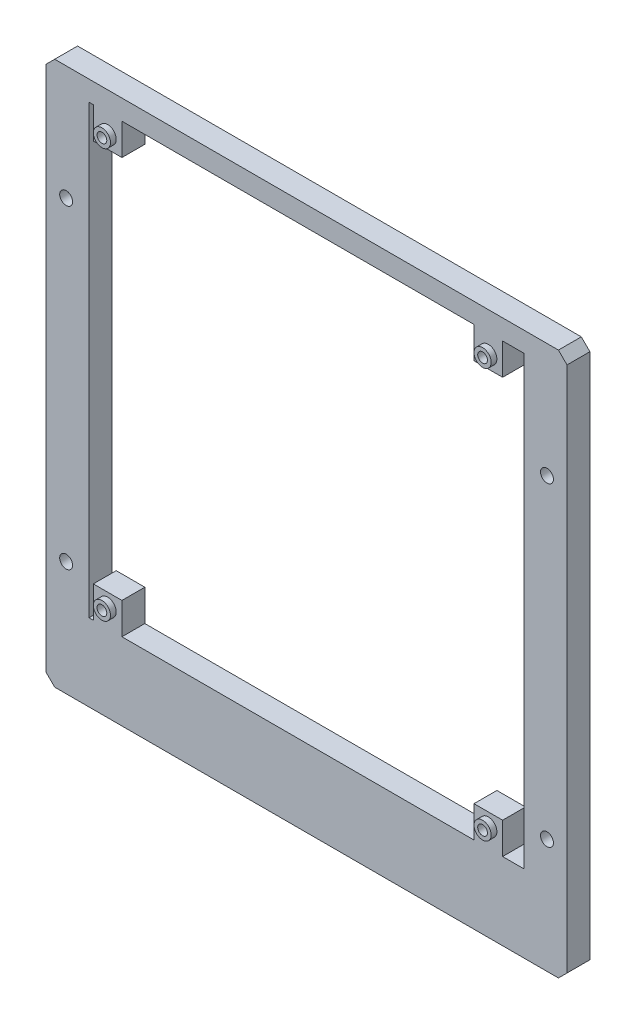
ISO-10303-21;
HEADER;
FILE_DESCRIPTION(('STEP AP214'),'2;1');
FILE_NAME('part.step','',(''),(''),'','','');
FILE_SCHEMA(('AUTOMOTIVE_DESIGN { 1 0 10303 214 1 1 1 1 }'));
ENDSEC;
DATA;
#1=APPLICATION_CONTEXT('core data for automotive mechanical design processes');
#2=APPLICATION_PROTOCOL_DEFINITION('international standard','automotive_design',2000,#1);
#3=PRODUCT_CONTEXT('',#1,'mechanical');
#4=PRODUCT('Part','Part','',(#3));
#5=PRODUCT_RELATED_PRODUCT_CATEGORY('part','',(#4));
#6=PRODUCT_DEFINITION_FORMATION('','',#4);
#7=PRODUCT_DEFINITION_CONTEXT('part definition',#1,'design');
#8=PRODUCT_DEFINITION('design','',#6,#7);
#9=PRODUCT_DEFINITION_SHAPE('','',#8);
#10=(LENGTH_UNIT() NAMED_UNIT(*) SI_UNIT(.MILLI.,.METRE.));
#11=(NAMED_UNIT(*) PLANE_ANGLE_UNIT() SI_UNIT($,.RADIAN.));
#12=(NAMED_UNIT(*) SI_UNIT($,.STERADIAN.) SOLID_ANGLE_UNIT());
#13=UNCERTAINTY_MEASURE_WITH_UNIT(LENGTH_MEASURE(1.E-05),#10,'distance_accuracy_value','');
#14=(GEOMETRIC_REPRESENTATION_CONTEXT(3) GLOBAL_UNCERTAINTY_ASSIGNED_CONTEXT((#13)) GLOBAL_UNIT_ASSIGNED_CONTEXT((#10,
#11,#12)) REPRESENTATION_CONTEXT('',''));
#15=CARTESIAN_POINT('',(0.,0.,0.));
#16=DIRECTION('',(0.,0.,1.));
#17=DIRECTION('',(1.,0.,0.));
#18=AXIS2_PLACEMENT_3D('',#15,#16,#17);
#19=CARTESIAN_POINT('',(0.,0.,8.));
#20=DIRECTION('',(0.,0.,1.));
#21=DIRECTION('',(1.,0.,0.));
#22=AXIS2_PLACEMENT_3D('',#19,#20,#21);
#23=PLANE('',#22);
#24=CARTESIAN_POINT('',(-79.5,81.5,8.));
#25=DIRECTION('',(0.,0.,1.));
#26=DIRECTION('',(1.,0.,0.));
#27=AXIS2_PLACEMENT_3D('',#24,#25,#26);
#28=CIRCLE('',#27,3.);
#29=CARTESIAN_POINT('',(-76.5,81.5,8.));
#30=VERTEX_POINT('',#29);
#31=EDGE_CURVE('E547',#30,#30,#28,.T.);
#32=ORIENTED_EDGE('',*,*,#31,.F.);
#33=EDGE_LOOP('',(#32));
#34=FACE_BOUND('',#33,.T.);
#35=CARTESIAN_POINT('',(-79.5,-61.5,8.));
#36=DIRECTION('',(0.,0.,1.));
#37=DIRECTION('',(1.,0.,0.));
#38=AXIS2_PLACEMENT_3D('',#35,#36,#37);
#39=CIRCLE('',#38,3.);
#40=CARTESIAN_POINT('',(-76.5,-61.5,8.));
#41=VERTEX_POINT('',#40);
#42=EDGE_CURVE('E534',#41,#41,#39,.T.);
#43=ORIENTED_EDGE('',*,*,#42,.F.);
#44=EDGE_LOOP('',(#43));
#45=FACE_BOUND('',#44,.T.);
#46=DIRECTION('',(-1.,0.,0.));
#47=VECTOR('',#46,1.);
#48=CARTESIAN_POINT('',(66.,88.,8.));
#49=LINE('',#48,#47);
#50=CARTESIAN_POINT('',(48.5,88.,8.));
#51=VERTEX_POINT('',#50);
#52=CARTESIAN_POINT('',(-74.5,88.,8.));
#53=VERTEX_POINT('',#52);
#54=EDGE_CURVE('E237',#51,#53,#49,.T.);
#55=ORIENTED_EDGE('',*,*,#54,.F.);
#56=DIRECTION('',(0.,-1.,0.));
#57=VECTOR('',#56,1.);
#58=CARTESIAN_POINT('',(48.5,92.,8.));
#59=LINE('',#58,#57);
#60=CARTESIAN_POINT('',(48.5,77.,8.));
#61=VERTEX_POINT('',#60);
#62=EDGE_CURVE('E230',#51,#61,#59,.T.);
#63=ORIENTED_EDGE('',*,*,#62,.T.);
#64=DIRECTION('',(1.,0.,0.));
#65=VECTOR('',#64,1.);
#66=CARTESIAN_POINT('',(48.5,77.,8.));
#67=LINE('',#66,#65);
#68=CARTESIAN_POINT('',(58.5,77.,8.));
#69=VERTEX_POINT('',#68);
#70=EDGE_CURVE('E234',#61,#69,#67,.T.);
#71=ORIENTED_EDGE('',*,*,#70,.T.);
#72=DIRECTION('',(0.,1.,0.));
#73=VECTOR('',#72,1.);
#74=CARTESIAN_POINT('',(58.5,77.,8.));
#75=LINE('',#74,#73);
#76=CARTESIAN_POINT('',(58.5,88.,8.));
#77=VERTEX_POINT('',#76);
#78=EDGE_CURVE('E248',#69,#77,#75,.T.);
#79=ORIENTED_EDGE('',*,*,#78,.T.);
#80=CARTESIAN_POINT('',(66.,88.,8.));
#81=VERTEX_POINT('',#80);
#82=EDGE_CURVE('E369',#81,#77,#49,.T.);
#83=ORIENTED_EDGE('',*,*,#82,.F.);
#84=DIRECTION('',(0.,1.,0.));
#85=VECTOR('',#84,1.);
#86=CARTESIAN_POINT('',(66.,-68.,8.));
#87=LINE('',#86,#85);
#88=CARTESIAN_POINT('',(66.,-68.,8.));
#89=VERTEX_POINT('',#88);
#90=EDGE_CURVE('E364',#89,#81,#87,.T.);
#91=ORIENTED_EDGE('',*,*,#90,.F.);
#92=DIRECTION('',(1.,0.,0.));
#93=VECTOR('',#92,1.);
#94=CARTESIAN_POINT('',(-86.,-68.,8.));
#95=LINE('',#94,#93);
#96=CARTESIAN_POINT('',(58.5,-68.,8.));
#97=VERTEX_POINT('',#96);
#98=EDGE_CURVE('E359',#97,#89,#95,.T.);
#99=ORIENTED_EDGE('',*,*,#98,.F.);
#100=DIRECTION('',(0.,1.,0.));
#101=VECTOR('',#100,1.);
#102=CARTESIAN_POINT('',(58.5,-92.,8.));
#103=LINE('',#102,#101);
#104=CARTESIAN_POINT('',(58.5,-57.,8.));
#105=VERTEX_POINT('',#104);
#106=EDGE_CURVE('E289',#97,#105,#103,.T.);
#107=ORIENTED_EDGE('',*,*,#106,.T.);
#108=DIRECTION('',(-1.,0.,0.));
#109=VECTOR('',#108,1.);
#110=CARTESIAN_POINT('',(58.5,-57.,8.));
#111=LINE('',#110,#109);
#112=CARTESIAN_POINT('',(48.5,-57.,8.));
#113=VERTEX_POINT('',#112);
#114=EDGE_CURVE('E292',#105,#113,#111,.T.);
#115=ORIENTED_EDGE('',*,*,#114,.T.);
#116=DIRECTION('',(0.,-1.,0.));
#117=VECTOR('',#116,1.);
#118=CARTESIAN_POINT('',(48.5,-57.,8.));
#119=LINE('',#118,#117);
#120=CARTESIAN_POINT('',(48.5,-68.,8.));
#121=VERTEX_POINT('',#120);
#122=EDGE_CURVE('E286',#113,#121,#119,.T.);
#123=ORIENTED_EDGE('',*,*,#122,.T.);
#124=CARTESIAN_POINT('',(-74.5,-68.,8.));
#125=VERTEX_POINT('',#124);
#126=EDGE_CURVE('E365',#125,#121,#95,.T.);
#127=ORIENTED_EDGE('',*,*,#126,.F.);
#128=DIRECTION('',(0.,1.,0.));
#129=VECTOR('',#128,1.);
#130=CARTESIAN_POINT('',(-74.5,-92.,8.));
#131=LINE('',#130,#129);
#132=CARTESIAN_POINT('',(-74.5,-57.,8.));
#133=VERTEX_POINT('',#132);
#134=EDGE_CURVE('E317',#125,#133,#131,.T.);
#135=ORIENTED_EDGE('',*,*,#134,.T.);
#136=DIRECTION('',(-1.,0.,0.));
#137=VECTOR('',#136,1.);
#138=CARTESIAN_POINT('',(-74.5,-57.,8.));
#139=LINE('',#138,#137);
#140=CARTESIAN_POINT('',(-84.5,-57.,8.));
#141=VERTEX_POINT('',#140);
#142=EDGE_CURVE('E320',#133,#141,#139,.T.);
#143=ORIENTED_EDGE('',*,*,#142,.T.);
#144=DIRECTION('',(0.,-1.,0.));
#145=VECTOR('',#144,1.);
#146=CARTESIAN_POINT('',(-84.5,-57.,8.));
#147=LINE('',#146,#145);
#148=CARTESIAN_POINT('',(-84.5,-68.,8.));
#149=VERTEX_POINT('',#148);
#150=EDGE_CURVE('E314',#141,#149,#147,.T.);
#151=ORIENTED_EDGE('',*,*,#150,.T.);
#152=CARTESIAN_POINT('',(-86.,-68.,8.));
#153=VERTEX_POINT('',#152);
#154=EDGE_CURVE('E361',#153,#149,#95,.T.);
#155=ORIENTED_EDGE('',*,*,#154,.F.);
#156=DIRECTION('',(0.,-1.,0.));
#157=VECTOR('',#156,1.);
#158=CARTESIAN_POINT('',(-86.,88.,8.));
#159=LINE('',#158,#157);
#160=CARTESIAN_POINT('',(-86.,88.,8.));
#161=VERTEX_POINT('',#160);
#162=EDGE_CURVE('E357',#161,#153,#159,.T.);
#163=ORIENTED_EDGE('',*,*,#162,.F.);
#164=CARTESIAN_POINT('',(-84.5,88.,8.));
#165=VERTEX_POINT('',#164);
#166=EDGE_CURVE('E368',#165,#161,#49,.T.);
#167=ORIENTED_EDGE('',*,*,#166,.F.);
#168=DIRECTION('',(0.,-1.,0.));
#169=VECTOR('',#168,1.);
#170=CARTESIAN_POINT('',(-84.5,92.,8.));
#171=LINE('',#170,#169);
#172=CARTESIAN_POINT('',(-84.5,77.,8.));
#173=VERTEX_POINT('',#172);
#174=EDGE_CURVE('E265',#165,#173,#171,.T.);
#175=ORIENTED_EDGE('',*,*,#174,.T.);
#176=DIRECTION('',(1.,0.,0.));
#177=VECTOR('',#176,1.);
#178=CARTESIAN_POINT('',(-84.5,77.,8.));
#179=LINE('',#178,#177);
#180=CARTESIAN_POINT('',(-74.5,77.,8.));
#181=VERTEX_POINT('',#180);
#182=EDGE_CURVE('E267',#173,#181,#179,.T.);
#183=ORIENTED_EDGE('',*,*,#182,.T.);
#184=DIRECTION('',(0.,1.,0.));
#185=VECTOR('',#184,1.);
#186=CARTESIAN_POINT('',(-74.5,77.,8.));
#187=LINE('',#186,#185);
#188=EDGE_CURVE('E270',#181,#53,#187,.T.);
#189=ORIENTED_EDGE('',*,*,#188,.T.);
#190=EDGE_LOOP('',(#55,#63,#71,#79,#83,#91,#99,#107,#115,#123,#127,#135,#143,#151,#155,#163,
#167,#175,#183,#189));
#191=FACE_BOUND('',#190,.T.);
#192=CARTESIAN_POINT('',(74.,-55.,8.));
#193=DIRECTION('',(0.,0.,1.));
#194=DIRECTION('',(1.,0.,0.));
#195=AXIS2_PLACEMENT_3D('',#192,#193,#194);
#196=CIRCLE('',#195,2.25);
#197=CARTESIAN_POINT('',(76.25,-55.,8.));
#198=VERTEX_POINT('',#197);
#199=EDGE_CURVE('E339',#198,#198,#196,.T.);
#200=ORIENTED_EDGE('',*,*,#199,.F.);
#201=EDGE_LOOP('',(#200));
#202=FACE_BOUND('',#201,.T.);
#203=CARTESIAN_POINT('',(-94.,-55.,8.));
#204=DIRECTION('',(0.,0.,1.));
#205=DIRECTION('',(1.,0.,0.));
#206=AXIS2_PLACEMENT_3D('',#203,#204,#205);
#207=CIRCLE('',#206,2.25);
#208=CARTESIAN_POINT('',(-91.75,-55.,8.));
#209=VERTEX_POINT('',#208);
#210=EDGE_CURVE('E351',#209,#209,#207,.T.);
#211=ORIENTED_EDGE('',*,*,#210,.F.);
#212=EDGE_LOOP('',(#211));
#213=FACE_BOUND('',#212,.T.);
#214=DIRECTION('',(0.707106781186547,-0.707106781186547,0.));
#215=VECTOR('',#214,1.);
#216=CARTESIAN_POINT('',(-101.,-92.,8.));
#217=LINE('',#216,#215);
#218=CARTESIAN_POINT('',(-101.,-92.,8.));
#219=VERTEX_POINT('',#218);
#220=CARTESIAN_POINT('',(-98.,-95.,8.));
#221=VERTEX_POINT('',#220);
#222=EDGE_CURVE('E397',#219,#221,#217,.T.);
#223=ORIENTED_EDGE('',*,*,#222,.T.);
#224=DIRECTION('',(1.,0.,0.));
#225=VECTOR('',#224,1.);
#226=CARTESIAN_POINT('',(-98.,-95.,8.));
#227=LINE('',#226,#225);
#228=CARTESIAN_POINT('',(78.,-95.,8.));
#229=VERTEX_POINT('',#228);
#230=EDGE_CURVE('E400',#221,#229,#227,.T.);
#231=ORIENTED_EDGE('',*,*,#230,.T.);
#232=DIRECTION('',(0.707106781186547,0.707106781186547,0.));
#233=VECTOR('',#232,1.);
#234=CARTESIAN_POINT('',(78.,-95.,8.));
#235=LINE('',#234,#233);
#236=CARTESIAN_POINT('',(81.,-92.,8.));
#237=VERTEX_POINT('',#236);
#238=EDGE_CURVE('E403',#229,#237,#235,.T.);
#239=ORIENTED_EDGE('',*,*,#238,.T.);
#240=DIRECTION('',(0.,1.,0.));
#241=VECTOR('',#240,1.);
#242=CARTESIAN_POINT('',(81.,-92.,8.));
#243=LINE('',#242,#241);
#244=CARTESIAN_POINT('',(81.,92.,8.));
#245=VERTEX_POINT('',#244);
#246=EDGE_CURVE('E405',#237,#245,#243,.T.);
#247=ORIENTED_EDGE('',*,*,#246,.T.);
#248=DIRECTION('',(-0.707106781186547,0.707106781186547,0.));
#249=VECTOR('',#248,1.);
#250=CARTESIAN_POINT('',(81.,92.,8.));
#251=LINE('',#250,#249);
#252=CARTESIAN_POINT('',(78.,95.,8.));
#253=VERTEX_POINT('',#252);
#254=EDGE_CURVE('E407',#245,#253,#251,.T.);
#255=ORIENTED_EDGE('',*,*,#254,.T.);
#256=DIRECTION('',(-1.,0.,0.));
#257=VECTOR('',#256,1.);
#258=CARTESIAN_POINT('',(78.,95.,8.));
#259=LINE('',#258,#257);
#260=CARTESIAN_POINT('',(-98.,95.,8.));
#261=VERTEX_POINT('',#260);
#262=EDGE_CURVE('E409',#253,#261,#259,.T.);
#263=ORIENTED_EDGE('',*,*,#262,.T.);
#264=DIRECTION('',(-0.707106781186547,-0.707106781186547,0.));
#265=VECTOR('',#264,1.);
#266=CARTESIAN_POINT('',(-98.,95.,8.));
#267=LINE('',#266,#265);
#268=CARTESIAN_POINT('',(-101.,92.,8.));
#269=VERTEX_POINT('',#268);
#270=EDGE_CURVE('E411',#261,#269,#267,.T.);
#271=ORIENTED_EDGE('',*,*,#270,.T.);
#272=DIRECTION('',(0.,-1.,0.));
#273=VECTOR('',#272,1.);
#274=CARTESIAN_POINT('',(-101.,92.,8.));
#275=LINE('',#274,#273);
#276=EDGE_CURVE('E413',#269,#219,#275,.T.);
#277=ORIENTED_EDGE('',*,*,#276,.T.);
#278=EDGE_LOOP('',(#223,#231,#239,#247,#255,#263,#271,#277));
#279=FACE_BOUND('',#278,.T.);
#280=CARTESIAN_POINT('',(-94.,55.,8.));
#281=DIRECTION('',(0.,0.,1.));
#282=DIRECTION('',(1.,0.,0.));
#283=AXIS2_PLACEMENT_3D('',#280,#281,#282);
#284=CIRCLE('',#283,2.25);
#285=CARTESIAN_POINT('',(-91.75,55.,8.));
#286=VERTEX_POINT('',#285);
#287=EDGE_CURVE('E345',#286,#286,#284,.T.);
#288=ORIENTED_EDGE('',*,*,#287,.F.);
#289=EDGE_LOOP('',(#288));
#290=FACE_BOUND('',#289,.T.);
#291=CARTESIAN_POINT('',(74.,55.,8.));
#292=DIRECTION('',(0.,0.,1.));
#293=DIRECTION('',(1.,0.,0.));
#294=AXIS2_PLACEMENT_3D('',#291,#292,#293);
#295=CIRCLE('',#294,2.25);
#296=CARTESIAN_POINT('',(76.25,55.,8.));
#297=VERTEX_POINT('',#296);
#298=EDGE_CURVE('E333',#297,#297,#295,.T.);
#299=ORIENTED_EDGE('',*,*,#298,.F.);
#300=EDGE_LOOP('',(#299));
#301=FACE_BOUND('',#300,.T.);
#302=CARTESIAN_POINT('',(53.5,81.5,8.));
#303=DIRECTION('',(0.,0.,1.));
#304=DIRECTION('',(1.,0.,0.));
#305=AXIS2_PLACEMENT_3D('',#302,#303,#304);
#306=CIRCLE('',#305,3.);
#307=CARTESIAN_POINT('',(56.5,81.5,8.));
#308=VERTEX_POINT('',#307);
#309=EDGE_CURVE('E563',#308,#308,#306,.T.);
#310=ORIENTED_EDGE('',*,*,#309,.F.);
#311=EDGE_LOOP('',(#310));
#312=FACE_BOUND('',#311,.T.);
#313=CARTESIAN_POINT('',(53.5,-61.5,8.));
#314=DIRECTION('',(0.,0.,1.));
#315=DIRECTION('',(1.,0.,0.));
#316=AXIS2_PLACEMENT_3D('',#313,#314,#315);
#317=CIRCLE('',#316,3.);
#318=CARTESIAN_POINT('',(56.5,-61.5,8.));
#319=VERTEX_POINT('',#318);
#320=EDGE_CURVE('E556',#319,#319,#317,.T.);
#321=ORIENTED_EDGE('',*,*,#320,.F.);
#322=EDGE_LOOP('',(#321));
#323=FACE_BOUND('',#322,.T.);
#324=ADVANCED_FACE('F43',(#34,#45,#191,#202,#213,#279,#290,#301,#312,#323),#23,.T.);
#325=CARTESIAN_POINT('',(66.,88.,8.));
#326=DIRECTION('',(0.,-1.,0.));
#327=DIRECTION('',(0.,0.,-1.));
#328=AXIS2_PLACEMENT_3D('',#325,#326,#327);
#329=PLANE('',#328);
#330=DIRECTION('',(-1.,0.,0.));
#331=VECTOR('',#330,1.);
#332=CARTESIAN_POINT('',(66.,88.,0.));
#333=LINE('',#332,#331);
#334=CARTESIAN_POINT('',(48.5,88.,0.));
#335=VERTEX_POINT('',#334);
#336=CARTESIAN_POINT('',(-74.5,88.,0.));
#337=VERTEX_POINT('',#336);
#338=EDGE_CURVE('E66',#335,#337,#333,.T.);
#339=ORIENTED_EDGE('',*,*,#338,.F.);
#340=DIRECTION('',(0.,0.,1.));
#341=VECTOR('',#340,1.);
#342=CARTESIAN_POINT('',(48.5,88.,8.));
#343=LINE('',#342,#341);
#344=EDGE_CURVE('E255',#335,#51,#343,.T.);
#345=ORIENTED_EDGE('',*,*,#344,.T.);
#346=ORIENTED_EDGE('',*,*,#54,.T.);
#347=DIRECTION('',(0.,0.,-1.));
#348=VECTOR('',#347,1.);
#349=CARTESIAN_POINT('',(-74.5,88.,8.));
#350=LINE('',#349,#348);
#351=EDGE_CURVE('E51',#53,#337,#350,.T.);
#352=ORIENTED_EDGE('',*,*,#351,.T.);
#353=EDGE_LOOP('',(#339,#345,#346,#352));
#354=FACE_BOUND('',#353,.T.);
#355=ADVANCED_FACE('F462',(#354),#329,.T.);
#356=ORIENTED_EDGE('',*,*,#82,.T.);
#357=DIRECTION('',(0.,0.,-1.));
#358=VECTOR('',#357,1.);
#359=CARTESIAN_POINT('',(58.5,88.,8.));
#360=LINE('',#359,#358);
#361=CARTESIAN_POINT('',(58.5,88.,0.));
#362=VERTEX_POINT('',#361);
#363=EDGE_CURVE('E253',#77,#362,#360,.T.);
#364=ORIENTED_EDGE('',*,*,#363,.T.);
#365=CARTESIAN_POINT('',(66.,88.,0.));
#366=VERTEX_POINT('',#365);
#367=EDGE_CURVE('E360',#366,#362,#333,.T.);
#368=ORIENTED_EDGE('',*,*,#367,.F.);
#369=DIRECTION('',(0.,0.,-1.));
#370=VECTOR('',#369,1.);
#371=CARTESIAN_POINT('',(66.,88.,8.));
#372=LINE('',#371,#370);
#373=EDGE_CURVE('E388',#81,#366,#372,.T.);
#374=ORIENTED_EDGE('',*,*,#373,.F.);
#375=EDGE_LOOP('',(#356,#364,#368,#374));
#376=FACE_BOUND('',#375,.T.);
#377=ADVANCED_FACE('F524',(#376),#329,.T.);
#378=CARTESIAN_POINT('',(-84.5,88.,0.));
#379=VERTEX_POINT('',#378);
#380=CARTESIAN_POINT('',(-86.,88.,0.));
#381=VERTEX_POINT('',#380);
#382=EDGE_CURVE('E383',#379,#381,#333,.T.);
#383=ORIENTED_EDGE('',*,*,#382,.F.);
#384=DIRECTION('',(0.,0.,1.));
#385=VECTOR('',#384,1.);
#386=CARTESIAN_POINT('',(-84.5,88.,8.));
#387=LINE('',#386,#385);
#388=EDGE_CURVE('E11',#379,#165,#387,.T.);
#389=ORIENTED_EDGE('',*,*,#388,.T.);
#390=ORIENTED_EDGE('',*,*,#166,.T.);
#391=DIRECTION('',(0.,0.,-1.));
#392=VECTOR('',#391,1.);
#393=CARTESIAN_POINT('',(-86.,88.,8.));
#394=LINE('',#393,#392);
#395=EDGE_CURVE('E372',#161,#381,#394,.T.);
#396=ORIENTED_EDGE('',*,*,#395,.T.);
#397=EDGE_LOOP('',(#383,#389,#390,#396));
#398=FACE_BOUND('',#397,.T.);
#399=ADVANCED_FACE('F480',(#398),#329,.T.);
#400=CARTESIAN_POINT('',(-86.,-68.,8.));
#401=DIRECTION('',(0.,1.,0.));
#402=DIRECTION('',(0.,0.,1.));
#403=AXIS2_PLACEMENT_3D('',#400,#401,#402);
#404=PLANE('',#403);
#405=ORIENTED_EDGE('',*,*,#126,.T.);
#406=DIRECTION('',(0.,0.,-1.));
#407=VECTOR('',#406,1.);
#408=CARTESIAN_POINT('',(48.5,-68.,8.));
#409=LINE('',#408,#407);
#410=CARTESIAN_POINT('',(48.5,-68.,0.));
#411=VERTEX_POINT('',#410);
#412=EDGE_CURVE('E307',#121,#411,#409,.T.);
#413=ORIENTED_EDGE('',*,*,#412,.T.);
#414=DIRECTION('',(1.,0.,0.));
#415=VECTOR('',#414,1.);
#416=CARTESIAN_POINT('',(-86.,-68.,0.));
#417=LINE('',#416,#415);
#418=CARTESIAN_POINT('',(-74.5,-68.,0.));
#419=VERTEX_POINT('',#418);
#420=EDGE_CURVE('E380',#419,#411,#417,.T.);
#421=ORIENTED_EDGE('',*,*,#420,.F.);
#422=DIRECTION('',(0.,0.,1.));
#423=VECTOR('',#422,1.);
#424=CARTESIAN_POINT('',(-74.5,-68.,8.));
#425=LINE('',#424,#423);
#426=EDGE_CURVE('E454',#419,#125,#425,.T.);
#427=ORIENTED_EDGE('',*,*,#426,.T.);
#428=EDGE_LOOP('',(#405,#413,#421,#427));
#429=FACE_BOUND('',#428,.T.);
#430=ADVANCED_FACE('F508',(#429),#404,.T.);
#431=CARTESIAN_POINT('',(58.5,-68.,0.));
#432=VERTEX_POINT('',#431);
#433=CARTESIAN_POINT('',(66.,-68.,0.));
#434=VERTEX_POINT('',#433);
#435=EDGE_CURVE('E375',#432,#434,#417,.T.);
#436=ORIENTED_EDGE('',*,*,#435,.F.);
#437=DIRECTION('',(0.,0.,1.));
#438=VECTOR('',#437,1.);
#439=CARTESIAN_POINT('',(58.5,-68.,8.));
#440=LINE('',#439,#438);
#441=EDGE_CURVE('E304',#432,#97,#440,.T.);
#442=ORIENTED_EDGE('',*,*,#441,.T.);
#443=ORIENTED_EDGE('',*,*,#98,.T.);
#444=DIRECTION('',(0.,0.,-1.));
#445=VECTOR('',#444,1.);
#446=CARTESIAN_POINT('',(66.,-68.,8.));
#447=LINE('',#446,#445);
#448=EDGE_CURVE('E390',#89,#434,#447,.T.);
#449=ORIENTED_EDGE('',*,*,#448,.T.);
#450=EDGE_LOOP('',(#436,#442,#443,#449));
#451=FACE_BOUND('',#450,.T.);
#452=ADVANCED_FACE('F516',(#451),#404,.T.);
#453=ORIENTED_EDGE('',*,*,#154,.T.);
#454=DIRECTION('',(0.,0.,-1.));
#455=VECTOR('',#454,1.);
#456=CARTESIAN_POINT('',(-84.5,-68.,8.));
#457=LINE('',#456,#455);
#458=CARTESIAN_POINT('',(-84.5,-68.,0.));
#459=VERTEX_POINT('',#458);
#460=EDGE_CURVE('E457',#149,#459,#457,.T.);
#461=ORIENTED_EDGE('',*,*,#460,.T.);
#462=CARTESIAN_POINT('',(-86.,-68.,0.));
#463=VERTEX_POINT('',#462);
#464=EDGE_CURVE('E376',#463,#459,#417,.T.);
#465=ORIENTED_EDGE('',*,*,#464,.F.);
#466=DIRECTION('',(0.,0.,-1.));
#467=VECTOR('',#466,1.);
#468=CARTESIAN_POINT('',(-86.,-68.,8.));
#469=LINE('',#468,#467);
#470=EDGE_CURVE('E393',#153,#463,#469,.T.);
#471=ORIENTED_EDGE('',*,*,#470,.F.);
#472=EDGE_LOOP('',(#453,#461,#465,#471));
#473=FACE_BOUND('',#472,.T.);
#474=ADVANCED_FACE('F489',(#473),#404,.T.);
#475=CARTESIAN_POINT('',(0.,0.,0.));
#476=DIRECTION('',(0.,0.,1.));
#477=DIRECTION('',(1.,0.,0.));
#478=AXIS2_PLACEMENT_3D('',#475,#476,#477);
#479=PLANE('',#478);
#480=ORIENTED_EDGE('',*,*,#367,.T.);
#481=DIRECTION('',(0.,1.,0.));
#482=VECTOR('',#481,1.);
#483=CARTESIAN_POINT('',(58.5,77.,0.));
#484=LINE('',#483,#482);
#485=CARTESIAN_POINT('',(58.5,77.,0.));
#486=VERTEX_POINT('',#485);
#487=EDGE_CURVE('E58',#486,#362,#484,.T.);
#488=ORIENTED_EDGE('',*,*,#487,.F.);
#489=DIRECTION('',(1.,0.,0.));
#490=VECTOR('',#489,1.);
#491=CARTESIAN_POINT('',(48.5,77.,0.));
#492=LINE('',#491,#490);
#493=CARTESIAN_POINT('',(48.5,77.,0.));
#494=VERTEX_POINT('',#493);
#495=EDGE_CURVE('E525',#494,#486,#492,.T.);
#496=ORIENTED_EDGE('',*,*,#495,.F.);
#497=DIRECTION('',(0.,-1.,0.));
#498=VECTOR('',#497,1.);
#499=CARTESIAN_POINT('',(48.5,92.,0.));
#500=LINE('',#499,#498);
#501=EDGE_CURVE('E251',#335,#494,#500,.T.);
#502=ORIENTED_EDGE('',*,*,#501,.F.);
#503=ORIENTED_EDGE('',*,*,#338,.T.);
#504=DIRECTION('',(0.,1.,0.));
#505=VECTOR('',#504,1.);
#506=CARTESIAN_POINT('',(-74.5,77.,0.));
#507=LINE('',#506,#505);
#508=CARTESIAN_POINT('',(-74.5,77.,0.));
#509=VERTEX_POINT('',#508);
#510=EDGE_CURVE('E268',#509,#337,#507,.T.);
#511=ORIENTED_EDGE('',*,*,#510,.F.);
#512=DIRECTION('',(1.,0.,0.));
#513=VECTOR('',#512,1.);
#514=CARTESIAN_POINT('',(-84.5,77.,0.));
#515=LINE('',#514,#513);
#516=CARTESIAN_POINT('',(-84.5,77.,0.));
#517=VERTEX_POINT('',#516);
#518=EDGE_CURVE('E274',#517,#509,#515,.T.);
#519=ORIENTED_EDGE('',*,*,#518,.F.);
#520=DIRECTION('',(0.,-1.,0.));
#521=VECTOR('',#520,1.);
#522=CARTESIAN_POINT('',(-84.5,92.,0.));
#523=LINE('',#522,#521);
#524=EDGE_CURVE('E264',#379,#517,#523,.T.);
#525=ORIENTED_EDGE('',*,*,#524,.F.);
#526=ORIENTED_EDGE('',*,*,#382,.T.);
#527=DIRECTION('',(0.,-1.,0.));
#528=VECTOR('',#527,1.);
#529=CARTESIAN_POINT('',(-86.,88.,0.));
#530=LINE('',#529,#528);
#531=EDGE_CURVE('E354',#381,#463,#530,.T.);
#532=ORIENTED_EDGE('',*,*,#531,.T.);
#533=ORIENTED_EDGE('',*,*,#464,.T.);
#534=DIRECTION('',(0.,-1.,0.));
#535=VECTOR('',#534,1.);
#536=CARTESIAN_POINT('',(-84.5,-57.,0.));
#537=LINE('',#536,#535);
#538=CARTESIAN_POINT('',(-84.5,-57.,0.));
#539=VERTEX_POINT('',#538);
#540=EDGE_CURVE('E313',#539,#459,#537,.T.);
#541=ORIENTED_EDGE('',*,*,#540,.F.);
#542=DIRECTION('',(-1.,0.,0.));
#543=VECTOR('',#542,1.);
#544=CARTESIAN_POINT('',(-74.5,-57.,0.));
#545=LINE('',#544,#543);
#546=CARTESIAN_POINT('',(-74.5,-57.,0.));
#547=VERTEX_POINT('',#546);
#548=EDGE_CURVE('E318',#547,#539,#545,.T.);
#549=ORIENTED_EDGE('',*,*,#548,.F.);
#550=DIRECTION('',(0.,1.,0.));
#551=VECTOR('',#550,1.);
#552=CARTESIAN_POINT('',(-74.5,-92.,0.));
#553=LINE('',#552,#551);
#554=EDGE_CURVE('E324',#419,#547,#553,.T.);
#555=ORIENTED_EDGE('',*,*,#554,.F.);
#556=ORIENTED_EDGE('',*,*,#420,.T.);
#557=DIRECTION('',(0.,-1.,0.));
#558=VECTOR('',#557,1.);
#559=CARTESIAN_POINT('',(48.5,-57.,0.));
#560=LINE('',#559,#558);
#561=CARTESIAN_POINT('',(48.5,-57.,0.));
#562=VERTEX_POINT('',#561);
#563=EDGE_CURVE('E285',#562,#411,#560,.T.);
#564=ORIENTED_EDGE('',*,*,#563,.F.);
#565=DIRECTION('',(-1.,0.,0.));
#566=VECTOR('',#565,1.);
#567=CARTESIAN_POINT('',(58.5,-57.,0.));
#568=LINE('',#567,#566);
#569=CARTESIAN_POINT('',(58.5,-57.,0.));
#570=VERTEX_POINT('',#569);
#571=EDGE_CURVE('E290',#570,#562,#568,.T.);
#572=ORIENTED_EDGE('',*,*,#571,.F.);
#573=DIRECTION('',(0.,1.,0.));
#574=VECTOR('',#573,1.);
#575=CARTESIAN_POINT('',(58.5,-92.,0.));
#576=LINE('',#575,#574);
#577=EDGE_CURVE('E296',#432,#570,#576,.T.);
#578=ORIENTED_EDGE('',*,*,#577,.F.);
#579=ORIENTED_EDGE('',*,*,#435,.T.);
#580=DIRECTION('',(0.,1.,0.));
#581=VECTOR('',#580,1.);
#582=CARTESIAN_POINT('',(66.,-68.,0.));
#583=LINE('',#582,#581);
#584=EDGE_CURVE('E379',#434,#366,#583,.T.);
#585=ORIENTED_EDGE('',*,*,#584,.T.);
#586=EDGE_LOOP('',(#480,#488,#496,#502,#503,#511,#519,#525,#526,#532,#533,#541,#549,#555,#556,
#564,#572,#578,#579,#585));
#587=FACE_BOUND('',#586,.T.);
#588=DIRECTION('',(0.707106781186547,-0.707106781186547,0.));
#589=VECTOR('',#588,1.);
#590=CARTESIAN_POINT('',(-101.,-92.,0.));
#591=LINE('',#590,#589);
#592=CARTESIAN_POINT('',(-101.,-92.,0.));
#593=VERTEX_POINT('',#592);
#594=CARTESIAN_POINT('',(-98.,-95.,0.));
#595=VERTEX_POINT('',#594);
#596=EDGE_CURVE('E396',#593,#595,#591,.T.);
#597=ORIENTED_EDGE('',*,*,#596,.F.);
#598=DIRECTION('',(0.,-1.,0.));
#599=VECTOR('',#598,1.);
#600=CARTESIAN_POINT('',(-101.,92.,0.));
#601=LINE('',#600,#599);
#602=CARTESIAN_POINT('',(-101.,92.,0.));
#603=VERTEX_POINT('',#602);
#604=EDGE_CURVE('E401',#603,#593,#601,.T.);
#605=ORIENTED_EDGE('',*,*,#604,.F.);
#606=DIRECTION('',(-0.707106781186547,-0.707106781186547,0.));
#607=VECTOR('',#606,1.);
#608=CARTESIAN_POINT('',(-98.,95.,0.));
#609=LINE('',#608,#607);
#610=CARTESIAN_POINT('',(-98.,95.,0.));
#611=VERTEX_POINT('',#610);
#612=EDGE_CURVE('E428',#611,#603,#609,.T.);
#613=ORIENTED_EDGE('',*,*,#612,.F.);
#614=DIRECTION('',(-1.,0.,0.));
#615=VECTOR('',#614,1.);
#616=CARTESIAN_POINT('',(78.,95.,0.));
#617=LINE('',#616,#615);
#618=CARTESIAN_POINT('',(78.,95.,0.));
#619=VERTEX_POINT('',#618);
#620=EDGE_CURVE('E426',#619,#611,#617,.T.);
#621=ORIENTED_EDGE('',*,*,#620,.F.);
#622=DIRECTION('',(-0.707106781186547,0.707106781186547,0.));
#623=VECTOR('',#622,1.);
#624=CARTESIAN_POINT('',(81.,92.,0.));
#625=LINE('',#624,#623);
#626=CARTESIAN_POINT('',(81.,92.,0.));
#627=VERTEX_POINT('',#626);
#628=EDGE_CURVE('E424',#627,#619,#625,.T.);
#629=ORIENTED_EDGE('',*,*,#628,.F.);
#630=DIRECTION('',(0.,1.,0.));
#631=VECTOR('',#630,1.);
#632=CARTESIAN_POINT('',(81.,-92.,0.));
#633=LINE('',#632,#631);
#634=CARTESIAN_POINT('',(81.,-92.,0.));
#635=VERTEX_POINT('',#634);
#636=EDGE_CURVE('E422',#635,#627,#633,.T.);
#637=ORIENTED_EDGE('',*,*,#636,.F.);
#638=DIRECTION('',(0.707106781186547,0.707106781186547,0.));
#639=VECTOR('',#638,1.);
#640=CARTESIAN_POINT('',(78.,-95.,0.));
#641=LINE('',#640,#639);
#642=CARTESIAN_POINT('',(78.,-95.,0.));
#643=VERTEX_POINT('',#642);
#644=EDGE_CURVE('E420',#643,#635,#641,.T.);
#645=ORIENTED_EDGE('',*,*,#644,.F.);
#646=DIRECTION('',(1.,0.,0.));
#647=VECTOR('',#646,1.);
#648=CARTESIAN_POINT('',(-98.,-95.,0.));
#649=LINE('',#648,#647);
#650=EDGE_CURVE('E418',#595,#643,#649,.T.);
#651=ORIENTED_EDGE('',*,*,#650,.F.);
#652=EDGE_LOOP('',(#597,#605,#613,#621,#629,#637,#645,#651));
#653=FACE_BOUND('',#652,.T.);
#654=CARTESIAN_POINT('',(-94.,-55.,0.));
#655=DIRECTION('',(0.,0.,1.));
#656=DIRECTION('',(1.,0.,0.));
#657=AXIS2_PLACEMENT_3D('',#654,#655,#656);
#658=CIRCLE('',#657,2.25);
#659=CARTESIAN_POINT('',(-91.75,-55.,0.));
#660=VERTEX_POINT('',#659);
#661=EDGE_CURVE('E348',#660,#660,#658,.T.);
#662=ORIENTED_EDGE('',*,*,#661,.T.);
#663=EDGE_LOOP('',(#662));
#664=FACE_BOUND('',#663,.T.);
#665=CARTESIAN_POINT('',(-94.,55.,0.));
#666=DIRECTION('',(0.,0.,1.));
#667=DIRECTION('',(1.,0.,0.));
#668=AXIS2_PLACEMENT_3D('',#665,#666,#667);
#669=CIRCLE('',#668,2.25);
#670=CARTESIAN_POINT('',(-91.75,55.,0.));
#671=VERTEX_POINT('',#670);
#672=EDGE_CURVE('E342',#671,#671,#669,.T.);
#673=ORIENTED_EDGE('',*,*,#672,.T.);
#674=EDGE_LOOP('',(#673));
#675=FACE_BOUND('',#674,.T.);
#676=CARTESIAN_POINT('',(74.,-55.,0.));
#677=DIRECTION('',(0.,0.,1.));
#678=DIRECTION('',(1.,0.,0.));
#679=AXIS2_PLACEMENT_3D('',#676,#677,#678);
#680=CIRCLE('',#679,2.25);
#681=CARTESIAN_POINT('',(76.25,-55.,0.));
#682=VERTEX_POINT('',#681);
#683=EDGE_CURVE('E336',#682,#682,#680,.T.);
#684=ORIENTED_EDGE('',*,*,#683,.T.);
#685=EDGE_LOOP('',(#684));
#686=FACE_BOUND('',#685,.T.);
#687=CARTESIAN_POINT('',(74.,55.,0.));
#688=DIRECTION('',(0.,0.,1.));
#689=DIRECTION('',(1.,0.,0.));
#690=AXIS2_PLACEMENT_3D('',#687,#688,#689);
#691=CIRCLE('',#690,2.25);
#692=CARTESIAN_POINT('',(76.25,55.,0.));
#693=VERTEX_POINT('',#692);
#694=EDGE_CURVE('E332',#693,#693,#691,.T.);
#695=ORIENTED_EDGE('',*,*,#694,.T.);
#696=EDGE_LOOP('',(#695));
#697=FACE_BOUND('',#696,.T.);
#698=CARTESIAN_POINT('',(-79.5,-61.5,0.));
#699=DIRECTION('',(0.,0.,1.));
#700=DIRECTION('',(1.,0.,0.));
#701=AXIS2_PLACEMENT_3D('',#698,#699,#700);
#702=CIRCLE('',#701,1.69999999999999);
#703=CARTESIAN_POINT('',(-77.8,-61.5,0.));
#704=VERTEX_POINT('',#703);
#705=EDGE_CURVE('E310',#704,#704,#702,.T.);
#706=ORIENTED_EDGE('',*,*,#705,.T.);
#707=EDGE_LOOP('',(#706));
#708=FACE_BOUND('',#707,.T.);
#709=CARTESIAN_POINT('',(53.5,-61.5,0.));
#710=DIRECTION('',(0.,0.,1.));
#711=DIRECTION('',(1.,0.,0.));
#712=AXIS2_PLACEMENT_3D('',#709,#710,#711);
#713=CIRCLE('',#712,1.7);
#714=CARTESIAN_POINT('',(55.2,-61.5,0.));
#715=VERTEX_POINT('',#714);
#716=EDGE_CURVE('E282',#715,#715,#713,.T.);
#717=ORIENTED_EDGE('',*,*,#716,.T.);
#718=EDGE_LOOP('',(#717));
#719=FACE_BOUND('',#718,.T.);
#720=CARTESIAN_POINT('',(-79.5,81.5,0.));
#721=DIRECTION('',(0.,0.,1.));
#722=DIRECTION('',(1.,0.,0.));
#723=AXIS2_PLACEMENT_3D('',#720,#721,#722);
#724=CIRCLE('',#723,1.69999999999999);
#725=CARTESIAN_POINT('',(-77.8,81.5,0.));
#726=VERTEX_POINT('',#725);
#727=EDGE_CURVE('E261',#726,#726,#724,.T.);
#728=ORIENTED_EDGE('',*,*,#727,.T.);
#729=EDGE_LOOP('',(#728));
#730=FACE_BOUND('',#729,.T.);
#731=CARTESIAN_POINT('',(53.5,81.5,0.));
#732=DIRECTION('',(0.,0.,1.));
#733=DIRECTION('',(1.,0.,0.));
#734=AXIS2_PLACEMENT_3D('',#731,#732,#733);
#735=CIRCLE('',#734,1.7);
#736=CARTESIAN_POINT('',(55.2,81.5,0.));
#737=VERTEX_POINT('',#736);
#738=EDGE_CURVE('E529',#737,#737,#735,.T.);
#739=ORIENTED_EDGE('',*,*,#738,.T.);
#740=EDGE_LOOP('',(#739));
#741=FACE_BOUND('',#740,.T.);
#742=ADVANCED_FACE('F473',(#587,#653,#664,#675,#686,#697,#708,#719,#730,#741),#479,.F.);
#743=CARTESIAN_POINT('',(-101.,-92.,8.));
#744=DIRECTION('',(0.707106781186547,0.707106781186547,0.));
#745=DIRECTION('',(-0.707106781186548,0.707106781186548,0.));
#746=AXIS2_PLACEMENT_3D('',#743,#744,#745);
#747=PLANE('',#746);
#748=ORIENTED_EDGE('',*,*,#596,.T.);
#749=DIRECTION('',(0.,0.,-1.));
#750=VECTOR('',#749,1.);
#751=CARTESIAN_POINT('',(-98.,-95.,8.));
#752=LINE('',#751,#750);
#753=EDGE_CURVE('E451',#221,#595,#752,.T.);
#754=ORIENTED_EDGE('',*,*,#753,.F.);
#755=ORIENTED_EDGE('',*,*,#222,.F.);
#756=DIRECTION('',(0.,0.,-1.));
#757=VECTOR('',#756,1.);
#758=CARTESIAN_POINT('',(-101.,-92.,8.));
#759=LINE('',#758,#757);
#760=EDGE_CURVE('E415',#219,#593,#759,.T.);
#761=ORIENTED_EDGE('',*,*,#760,.T.);
#762=EDGE_LOOP('',(#748,#754,#755,#761));
#763=FACE_BOUND('',#762,.T.);
#764=ADVANCED_FACE('F45',(#763),#747,.F.);
#765=CARTESIAN_POINT('',(-98.,-95.,8.));
#766=DIRECTION('',(0.,1.,0.));
#767=DIRECTION('',(0.,0.,1.));
#768=AXIS2_PLACEMENT_3D('',#765,#766,#767);
#769=PLANE('',#768);
#770=ORIENTED_EDGE('',*,*,#650,.T.);
#771=DIRECTION('',(0.,0.,-1.));
#772=VECTOR('',#771,1.);
#773=CARTESIAN_POINT('',(78.,-95.,8.));
#774=LINE('',#773,#772);
#775=EDGE_CURVE('E448',#229,#643,#774,.T.);
#776=ORIENTED_EDGE('',*,*,#775,.F.);
#777=ORIENTED_EDGE('',*,*,#230,.F.);
#778=ORIENTED_EDGE('',*,*,#753,.T.);
#779=EDGE_LOOP('',(#770,#776,#777,#778));
#780=FACE_BOUND('',#779,.T.);
#781=ADVANCED_FACE('F704',(#780),#769,.F.);
#782=CARTESIAN_POINT('',(78.,-95.,8.));
#783=DIRECTION('',(-0.707106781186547,0.707106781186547,0.));
#784=DIRECTION('',(-0.707106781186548,-0.707106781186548,0.));
#785=AXIS2_PLACEMENT_3D('',#782,#783,#784);
#786=PLANE('',#785);
#787=ORIENTED_EDGE('',*,*,#644,.T.);
#788=DIRECTION('',(0.,0.,-1.));
#789=VECTOR('',#788,1.);
#790=CARTESIAN_POINT('',(81.,-92.,8.));
#791=LINE('',#790,#789);
#792=EDGE_CURVE('E445',#237,#635,#791,.T.);
#793=ORIENTED_EDGE('',*,*,#792,.F.);
#794=ORIENTED_EDGE('',*,*,#238,.F.);
#795=ORIENTED_EDGE('',*,*,#775,.T.);
#796=EDGE_LOOP('',(#787,#793,#794,#795));
#797=FACE_BOUND('',#796,.T.);
#798=ADVANCED_FACE('F701',(#797),#786,.F.);
#799=CARTESIAN_POINT('',(81.,-92.,8.));
#800=DIRECTION('',(-1.,0.,0.));
#801=DIRECTION('',(0.,0.,1.));
#802=AXIS2_PLACEMENT_3D('',#799,#800,#801);
#803=PLANE('',#802);
#804=ORIENTED_EDGE('',*,*,#636,.T.);
#805=DIRECTION('',(0.,0.,-1.));
#806=VECTOR('',#805,1.);
#807=CARTESIAN_POINT('',(81.,92.,8.));
#808=LINE('',#807,#806);
#809=EDGE_CURVE('E442',#245,#627,#808,.T.);
#810=ORIENTED_EDGE('',*,*,#809,.F.);
#811=ORIENTED_EDGE('',*,*,#246,.F.);
#812=ORIENTED_EDGE('',*,*,#792,.T.);
#813=EDGE_LOOP('',(#804,#810,#811,#812));
#814=FACE_BOUND('',#813,.T.);
#815=ADVANCED_FACE('F697',(#814),#803,.F.);
#816=CARTESIAN_POINT('',(81.,92.,8.));
#817=DIRECTION('',(-0.707106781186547,-0.707106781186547,0.));
#818=DIRECTION('',(0.707106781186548,-0.707106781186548,0.));
#819=AXIS2_PLACEMENT_3D('',#816,#817,#818);
#820=PLANE('',#819);
#821=ORIENTED_EDGE('',*,*,#628,.T.);
#822=DIRECTION('',(0.,0.,-1.));
#823=VECTOR('',#822,1.);
#824=CARTESIAN_POINT('',(78.,95.,8.));
#825=LINE('',#824,#823);
#826=EDGE_CURVE('E439',#253,#619,#825,.T.);
#827=ORIENTED_EDGE('',*,*,#826,.F.);
#828=ORIENTED_EDGE('',*,*,#254,.F.);
#829=ORIENTED_EDGE('',*,*,#809,.T.);
#830=EDGE_LOOP('',(#821,#827,#828,#829));
#831=FACE_BOUND('',#830,.T.);
#832=ADVANCED_FACE('F693',(#831),#820,.F.);
#833=CARTESIAN_POINT('',(78.,95.,8.));
#834=DIRECTION('',(0.,-1.,0.));
#835=DIRECTION('',(0.,0.,-1.));
#836=AXIS2_PLACEMENT_3D('',#833,#834,#835);
#837=PLANE('',#836);
#838=ORIENTED_EDGE('',*,*,#620,.T.);
#839=DIRECTION('',(0.,0.,-1.));
#840=VECTOR('',#839,1.);
#841=CARTESIAN_POINT('',(-98.,95.,8.));
#842=LINE('',#841,#840);
#843=EDGE_CURVE('E436',#261,#611,#842,.T.);
#844=ORIENTED_EDGE('',*,*,#843,.F.);
#845=ORIENTED_EDGE('',*,*,#262,.F.);
#846=ORIENTED_EDGE('',*,*,#826,.T.);
#847=EDGE_LOOP('',(#838,#844,#845,#846));
#848=FACE_BOUND('',#847,.T.);
#849=ADVANCED_FACE('F689',(#848),#837,.F.);
#850=CARTESIAN_POINT('',(-98.,95.,8.));
#851=DIRECTION('',(0.707106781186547,-0.707106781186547,0.));
#852=DIRECTION('',(0.707106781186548,0.707106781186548,0.));
#853=AXIS2_PLACEMENT_3D('',#850,#851,#852);
#854=PLANE('',#853);
#855=ORIENTED_EDGE('',*,*,#612,.T.);
#856=DIRECTION('',(0.,0.,-1.));
#857=VECTOR('',#856,1.);
#858=CARTESIAN_POINT('',(-101.,92.,8.));
#859=LINE('',#858,#857);
#860=EDGE_CURVE('E433',#269,#603,#859,.T.);
#861=ORIENTED_EDGE('',*,*,#860,.F.);
#862=ORIENTED_EDGE('',*,*,#270,.F.);
#863=ORIENTED_EDGE('',*,*,#843,.T.);
#864=EDGE_LOOP('',(#855,#861,#862,#863));
#865=FACE_BOUND('',#864,.T.);
#866=ADVANCED_FACE('F685',(#865),#854,.F.);
#867=CARTESIAN_POINT('',(-101.,92.,8.));
#868=DIRECTION('',(1.,0.,0.));
#869=DIRECTION('',(0.,0.,-1.));
#870=AXIS2_PLACEMENT_3D('',#867,#868,#869);
#871=PLANE('',#870);
#872=ORIENTED_EDGE('',*,*,#604,.T.);
#873=ORIENTED_EDGE('',*,*,#760,.F.);
#874=ORIENTED_EDGE('',*,*,#276,.F.);
#875=ORIENTED_EDGE('',*,*,#860,.T.);
#876=EDGE_LOOP('',(#872,#873,#874,#875));
#877=FACE_BOUND('',#876,.T.);
#878=ADVANCED_FACE('F679',(#877),#871,.F.);
#879=CARTESIAN_POINT('',(-86.,88.,8.));
#880=DIRECTION('',(1.,0.,0.));
#881=DIRECTION('',(0.,0.,-1.));
#882=AXIS2_PLACEMENT_3D('',#879,#880,#881);
#883=PLANE('',#882);
#884=ORIENTED_EDGE('',*,*,#531,.F.);
#885=ORIENTED_EDGE('',*,*,#395,.F.);
#886=ORIENTED_EDGE('',*,*,#162,.T.);
#887=ORIENTED_EDGE('',*,*,#470,.T.);
#888=EDGE_LOOP('',(#884,#885,#886,#887));
#889=FACE_BOUND('',#888,.T.);
#890=ADVANCED_FACE('F487',(#889),#883,.T.);
#891=CARTESIAN_POINT('',(66.,-68.,8.));
#892=DIRECTION('',(-1.,0.,0.));
#893=DIRECTION('',(0.,0.,1.));
#894=AXIS2_PLACEMENT_3D('',#891,#892,#893);
#895=PLANE('',#894);
#896=ORIENTED_EDGE('',*,*,#584,.F.);
#897=ORIENTED_EDGE('',*,*,#448,.F.);
#898=ORIENTED_EDGE('',*,*,#90,.T.);
#899=ORIENTED_EDGE('',*,*,#373,.T.);
#900=EDGE_LOOP('',(#896,#897,#898,#899));
#901=FACE_BOUND('',#900,.T.);
#902=ADVANCED_FACE('F520',(#901),#895,.T.);
#903=CARTESIAN_POINT('',(-94.,-55.,8.));
#904=DIRECTION('',(0.,0.,-1.));
#905=DIRECTION('',(-1.,0.,0.));
#906=AXIS2_PLACEMENT_3D('',#903,#904,#905);
#907=CYLINDRICAL_SURFACE('',#906,2.25);
#908=ORIENTED_EDGE('',*,*,#210,.T.);
#909=EDGE_LOOP('',(#908));
#910=FACE_BOUND('',#909,.T.);
#911=ORIENTED_EDGE('',*,*,#661,.F.);
#912=EDGE_LOOP('',(#911));
#913=FACE_BOUND('',#912,.T.);
#914=ADVANCED_FACE('F667',(#910,#913),#907,.F.);
#915=CARTESIAN_POINT('',(-94.,55.,8.));
#916=DIRECTION('',(0.,0.,-1.));
#917=DIRECTION('',(-1.,0.,0.));
#918=AXIS2_PLACEMENT_3D('',#915,#916,#917);
#919=CYLINDRICAL_SURFACE('',#918,2.25);
#920=ORIENTED_EDGE('',*,*,#287,.T.);
#921=EDGE_LOOP('',(#920));
#922=FACE_BOUND('',#921,.T.);
#923=ORIENTED_EDGE('',*,*,#672,.F.);
#924=EDGE_LOOP('',(#923));
#925=FACE_BOUND('',#924,.T.);
#926=ADVANCED_FACE('F663',(#922,#925),#919,.F.);
#927=CARTESIAN_POINT('',(74.,-55.,8.));
#928=DIRECTION('',(0.,0.,-1.));
#929=DIRECTION('',(-1.,0.,0.));
#930=AXIS2_PLACEMENT_3D('',#927,#928,#929);
#931=CYLINDRICAL_SURFACE('',#930,2.25);
#932=ORIENTED_EDGE('',*,*,#199,.T.);
#933=EDGE_LOOP('',(#932));
#934=FACE_BOUND('',#933,.T.);
#935=ORIENTED_EDGE('',*,*,#683,.F.);
#936=EDGE_LOOP('',(#935));
#937=FACE_BOUND('',#936,.T.);
#938=ADVANCED_FACE('F659',(#934,#937),#931,.F.);
#939=CARTESIAN_POINT('',(74.,55.,8.));
#940=DIRECTION('',(0.,0.,-1.));
#941=DIRECTION('',(-1.,0.,0.));
#942=AXIS2_PLACEMENT_3D('',#939,#940,#941);
#943=CYLINDRICAL_SURFACE('',#942,2.25);
#944=ORIENTED_EDGE('',*,*,#298,.T.);
#945=EDGE_LOOP('',(#944));
#946=FACE_BOUND('',#945,.T.);
#947=ORIENTED_EDGE('',*,*,#694,.F.);
#948=EDGE_LOOP('',(#947));
#949=FACE_BOUND('',#948,.T.);
#950=ADVANCED_FACE('F656',(#946,#949),#943,.F.);
#951=CARTESIAN_POINT('',(-84.5,-57.,8.));
#952=DIRECTION('',(1.,0.,0.));
#953=DIRECTION('',(0.,0.,-1.));
#954=AXIS2_PLACEMENT_3D('',#951,#952,#953);
#955=PLANE('',#954);
#956=ORIENTED_EDGE('',*,*,#460,.F.);
#957=ORIENTED_EDGE('',*,*,#150,.F.);
#958=DIRECTION('',(0.,0.,-1.));
#959=VECTOR('',#958,1.);
#960=CARTESIAN_POINT('',(-84.5,-57.,8.));
#961=LINE('',#960,#959);
#962=EDGE_CURVE('E322',#141,#539,#961,.T.);
#963=ORIENTED_EDGE('',*,*,#962,.T.);
#964=ORIENTED_EDGE('',*,*,#540,.T.);
#965=EDGE_LOOP('',(#956,#957,#963,#964));
#966=FACE_BOUND('',#965,.T.);
#967=ADVANCED_FACE('F494',(#966),#955,.F.);
#968=CARTESIAN_POINT('',(-74.5,-92.,8.));
#969=DIRECTION('',(-1.,0.,0.));
#970=DIRECTION('',(0.,0.,1.));
#971=AXIS2_PLACEMENT_3D('',#968,#969,#970);
#972=PLANE('',#971);
#973=ORIENTED_EDGE('',*,*,#426,.F.);
#974=ORIENTED_EDGE('',*,*,#554,.T.);
#975=DIRECTION('',(0.,0.,-1.));
#976=VECTOR('',#975,1.);
#977=CARTESIAN_POINT('',(-74.5,-57.,8.));
#978=LINE('',#977,#976);
#979=EDGE_CURVE('E329',#133,#547,#978,.T.);
#980=ORIENTED_EDGE('',*,*,#979,.F.);
#981=ORIENTED_EDGE('',*,*,#134,.F.);
#982=EDGE_LOOP('',(#973,#974,#980,#981));
#983=FACE_BOUND('',#982,.T.);
#984=ADVANCED_FACE('F502',(#983),#972,.F.);
#985=CARTESIAN_POINT('',(-74.5,-57.,8.));
#986=DIRECTION('',(0.,-1.,0.));
#987=DIRECTION('',(0.,0.,-1.));
#988=AXIS2_PLACEMENT_3D('',#985,#986,#987);
#989=PLANE('',#988);
#990=ORIENTED_EDGE('',*,*,#548,.T.);
#991=ORIENTED_EDGE('',*,*,#962,.F.);
#992=ORIENTED_EDGE('',*,*,#142,.F.);
#993=ORIENTED_EDGE('',*,*,#979,.T.);
#994=EDGE_LOOP('',(#990,#991,#992,#993));
#995=FACE_BOUND('',#994,.T.);
#996=ADVANCED_FACE('F499',(#995),#989,.F.);
#997=CARTESIAN_POINT('',(-79.5,-61.5,8.));
#998=DIRECTION('',(0.,0.,-1.));
#999=DIRECTION('',(-1.,0.,0.));
#1000=AXIS2_PLACEMENT_3D('',#997,#998,#999);
#1001=CYLINDRICAL_SURFACE('',#1000,1.69999999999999);
#1002=ORIENTED_EDGE('',*,*,#705,.F.);
#1003=EDGE_LOOP('',(#1002));
#1004=FACE_BOUND('',#1003,.T.);
#1005=CARTESIAN_POINT('',(-79.5,-61.5,10.));
#1006=DIRECTION('',(0.,0.,1.));
#1007=DIRECTION('',(1.,0.,0.));
#1008=AXIS2_PLACEMENT_3D('',#1005,#1006,#1007);
#1009=CIRCLE('',#1008,1.69999999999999);
#1010=CARTESIAN_POINT('',(-77.8,-61.5,10.));
#1011=VERTEX_POINT('',#1010);
#1012=EDGE_CURVE('E537',#1011,#1011,#1009,.T.);
#1013=ORIENTED_EDGE('',*,*,#1012,.T.);
#1014=EDGE_LOOP('',(#1013));
#1015=FACE_BOUND('',#1014,.T.);
#1016=ADVANCED_FACE('F645',(#1004,#1015),#1001,.F.);
#1017=CARTESIAN_POINT('',(48.5,-57.,8.));
#1018=DIRECTION('',(1.,0.,0.));
#1019=DIRECTION('',(0.,0.,-1.));
#1020=AXIS2_PLACEMENT_3D('',#1017,#1018,#1019);
#1021=PLANE('',#1020);
#1022=ORIENTED_EDGE('',*,*,#412,.F.);
#1023=ORIENTED_EDGE('',*,*,#122,.F.);
#1024=DIRECTION('',(0.,0.,-1.));
#1025=VECTOR('',#1024,1.);
#1026=CARTESIAN_POINT('',(48.5,-57.,8.));
#1027=LINE('',#1026,#1025);
#1028=EDGE_CURVE('E294',#113,#562,#1027,.T.);
#1029=ORIENTED_EDGE('',*,*,#1028,.T.);
#1030=ORIENTED_EDGE('',*,*,#563,.T.);
#1031=EDGE_LOOP('',(#1022,#1023,#1029,#1030));
#1032=FACE_BOUND('',#1031,.T.);
#1033=ADVANCED_FACE('F641',(#1032),#1021,.F.);
#1034=CARTESIAN_POINT('',(58.5,-92.,8.));
#1035=DIRECTION('',(-1.,0.,0.));
#1036=DIRECTION('',(0.,0.,1.));
#1037=AXIS2_PLACEMENT_3D('',#1034,#1035,#1036);
#1038=PLANE('',#1037);
#1039=ORIENTED_EDGE('',*,*,#441,.F.);
#1040=ORIENTED_EDGE('',*,*,#577,.T.);
#1041=DIRECTION('',(0.,0.,-1.));
#1042=VECTOR('',#1041,1.);
#1043=CARTESIAN_POINT('',(58.5,-57.,8.));
#1044=LINE('',#1043,#1042);
#1045=EDGE_CURVE('E301',#105,#570,#1044,.T.);
#1046=ORIENTED_EDGE('',*,*,#1045,.F.);
#1047=ORIENTED_EDGE('',*,*,#106,.F.);
#1048=EDGE_LOOP('',(#1039,#1040,#1046,#1047));
#1049=FACE_BOUND('',#1048,.T.);
#1050=ADVANCED_FACE('F637',(#1049),#1038,.F.);
#1051=CARTESIAN_POINT('',(58.5,-57.,8.));
#1052=DIRECTION('',(0.,-1.,0.));
#1053=DIRECTION('',(0.,0.,-1.));
#1054=AXIS2_PLACEMENT_3D('',#1051,#1052,#1053);
#1055=PLANE('',#1054);
#1056=ORIENTED_EDGE('',*,*,#571,.T.);
#1057=ORIENTED_EDGE('',*,*,#1028,.F.);
#1058=ORIENTED_EDGE('',*,*,#114,.F.);
#1059=ORIENTED_EDGE('',*,*,#1045,.T.);
#1060=EDGE_LOOP('',(#1056,#1057,#1058,#1059));
#1061=FACE_BOUND('',#1060,.T.);
#1062=ADVANCED_FACE('F633',(#1061),#1055,.F.);
#1063=CARTESIAN_POINT('',(53.5,-61.5,8.));
#1064=DIRECTION('',(0.,0.,-1.));
#1065=DIRECTION('',(-1.,0.,0.));
#1066=AXIS2_PLACEMENT_3D('',#1063,#1064,#1065);
#1067=CYLINDRICAL_SURFACE('',#1066,1.7);
#1068=ORIENTED_EDGE('',*,*,#716,.F.);
#1069=EDGE_LOOP('',(#1068));
#1070=FACE_BOUND('',#1069,.T.);
#1071=CARTESIAN_POINT('',(53.5,-61.5,10.));
#1072=DIRECTION('',(0.,0.,1.));
#1073=DIRECTION('',(1.,0.,0.));
#1074=AXIS2_PLACEMENT_3D('',#1071,#1072,#1073);
#1075=CIRCLE('',#1074,1.7);
#1076=CARTESIAN_POINT('',(55.2,-61.5,10.));
#1077=VERTEX_POINT('',#1076);
#1078=EDGE_CURVE('E542',#1077,#1077,#1075,.T.);
#1079=ORIENTED_EDGE('',*,*,#1078,.T.);
#1080=EDGE_LOOP('',(#1079));
#1081=FACE_BOUND('',#1080,.T.);
#1082=ADVANCED_FACE('F630',(#1070,#1081),#1067,.F.);
#1083=CARTESIAN_POINT('',(-84.5,92.,8.));
#1084=DIRECTION('',(1.,0.,0.));
#1085=DIRECTION('',(0.,0.,-1.));
#1086=AXIS2_PLACEMENT_3D('',#1083,#1084,#1085);
#1087=PLANE('',#1086);
#1088=ORIENTED_EDGE('',*,*,#388,.F.);
#1089=ORIENTED_EDGE('',*,*,#524,.T.);
#1090=DIRECTION('',(0.,0.,-1.));
#1091=VECTOR('',#1090,1.);
#1092=CARTESIAN_POINT('',(-84.5,77.,8.));
#1093=LINE('',#1092,#1091);
#1094=EDGE_CURVE('E279',#173,#517,#1093,.T.);
#1095=ORIENTED_EDGE('',*,*,#1094,.F.);
#1096=ORIENTED_EDGE('',*,*,#174,.F.);
#1097=EDGE_LOOP('',(#1088,#1089,#1095,#1096));
#1098=FACE_BOUND('',#1097,.T.);
#1099=ADVANCED_FACE('F478',(#1098),#1087,.F.);
#1100=CARTESIAN_POINT('',(-84.5,77.,8.));
#1101=DIRECTION('',(0.,1.,0.));
#1102=DIRECTION('',(0.,0.,1.));
#1103=AXIS2_PLACEMENT_3D('',#1100,#1101,#1102);
#1104=PLANE('',#1103);
#1105=ORIENTED_EDGE('',*,*,#518,.T.);
#1106=DIRECTION('',(0.,0.,-1.));
#1107=VECTOR('',#1106,1.);
#1108=CARTESIAN_POINT('',(-74.5,77.,8.));
#1109=LINE('',#1108,#1107);
#1110=EDGE_CURVE('E272',#181,#509,#1109,.T.);
#1111=ORIENTED_EDGE('',*,*,#1110,.F.);
#1112=ORIENTED_EDGE('',*,*,#182,.F.);
#1113=ORIENTED_EDGE('',*,*,#1094,.T.);
#1114=EDGE_LOOP('',(#1105,#1111,#1112,#1113));
#1115=FACE_BOUND('',#1114,.T.);
#1116=ADVANCED_FACE('F471',(#1115),#1104,.F.);
#1117=CARTESIAN_POINT('',(-74.5,77.,8.));
#1118=DIRECTION('',(-1.,0.,0.));
#1119=DIRECTION('',(0.,0.,1.));
#1120=AXIS2_PLACEMENT_3D('',#1117,#1118,#1119);
#1121=PLANE('',#1120);
#1122=ORIENTED_EDGE('',*,*,#351,.F.);
#1123=ORIENTED_EDGE('',*,*,#188,.F.);
#1124=ORIENTED_EDGE('',*,*,#1110,.T.);
#1125=ORIENTED_EDGE('',*,*,#510,.T.);
#1126=EDGE_LOOP('',(#1122,#1123,#1124,#1125));
#1127=FACE_BOUND('',#1126,.T.);
#1128=ADVANCED_FACE('F465',(#1127),#1121,.F.);
#1129=CARTESIAN_POINT('',(-79.5,81.5,8.));
#1130=DIRECTION('',(0.,0.,-1.));
#1131=DIRECTION('',(-1.,0.,0.));
#1132=AXIS2_PLACEMENT_3D('',#1129,#1130,#1131);
#1133=CYLINDRICAL_SURFACE('',#1132,1.69999999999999);
#1134=ORIENTED_EDGE('',*,*,#727,.F.);
#1135=EDGE_LOOP('',(#1134));
#1136=FACE_BOUND('',#1135,.T.);
#1137=CARTESIAN_POINT('',(-79.5,81.5,10.));
#1138=DIRECTION('',(0.,0.,1.));
#1139=DIRECTION('',(1.,0.,0.));
#1140=AXIS2_PLACEMENT_3D('',#1137,#1138,#1139);
#1141=CIRCLE('',#1140,1.69999999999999);
#1142=CARTESIAN_POINT('',(-77.8,81.5,10.));
#1143=VERTEX_POINT('',#1142);
#1144=EDGE_CURVE('E543',#1143,#1143,#1141,.T.);
#1145=ORIENTED_EDGE('',*,*,#1144,.T.);
#1146=EDGE_LOOP('',(#1145));
#1147=FACE_BOUND('',#1146,.T.);
#1148=ADVANCED_FACE('F620',(#1136,#1147),#1133,.F.);
#1149=CARTESIAN_POINT('',(48.5,92.,8.));
#1150=DIRECTION('',(1.,0.,0.));
#1151=DIRECTION('',(0.,0.,-1.));
#1152=AXIS2_PLACEMENT_3D('',#1149,#1150,#1151);
#1153=PLANE('',#1152);
#1154=ORIENTED_EDGE('',*,*,#344,.F.);
#1155=ORIENTED_EDGE('',*,*,#501,.T.);
#1156=DIRECTION('',(0.,0.,-1.));
#1157=VECTOR('',#1156,1.);
#1158=CARTESIAN_POINT('',(48.5,77.,8.));
#1159=LINE('',#1158,#1157);
#1160=EDGE_CURVE('E245',#61,#494,#1159,.T.);
#1161=ORIENTED_EDGE('',*,*,#1160,.F.);
#1162=ORIENTED_EDGE('',*,*,#62,.F.);
#1163=EDGE_LOOP('',(#1154,#1155,#1161,#1162));
#1164=FACE_BOUND('',#1163,.T.);
#1165=ADVANCED_FACE('F250',(#1164),#1153,.F.);
#1166=CARTESIAN_POINT('',(48.5,77.,8.));
#1167=DIRECTION('',(0.,1.,0.));
#1168=DIRECTION('',(0.,0.,1.));
#1169=AXIS2_PLACEMENT_3D('',#1166,#1167,#1168);
#1170=PLANE('',#1169);
#1171=ORIENTED_EDGE('',*,*,#495,.T.);
#1172=DIRECTION('',(0.,0.,-1.));
#1173=VECTOR('',#1172,1.);
#1174=CARTESIAN_POINT('',(58.5,77.,8.));
#1175=LINE('',#1174,#1173);
#1176=EDGE_CURVE('E246',#69,#486,#1175,.T.);
#1177=ORIENTED_EDGE('',*,*,#1176,.F.);
#1178=ORIENTED_EDGE('',*,*,#70,.F.);
#1179=ORIENTED_EDGE('',*,*,#1160,.T.);
#1180=EDGE_LOOP('',(#1171,#1177,#1178,#1179));
#1181=FACE_BOUND('',#1180,.T.);
#1182=ADVANCED_FACE('F244',(#1181),#1170,.F.);
#1183=CARTESIAN_POINT('',(58.5,77.,8.));
#1184=DIRECTION('',(-1.,0.,0.));
#1185=DIRECTION('',(0.,0.,1.));
#1186=AXIS2_PLACEMENT_3D('',#1183,#1184,#1185);
#1187=PLANE('',#1186);
#1188=ORIENTED_EDGE('',*,*,#363,.F.);
#1189=ORIENTED_EDGE('',*,*,#78,.F.);
#1190=ORIENTED_EDGE('',*,*,#1176,.T.);
#1191=ORIENTED_EDGE('',*,*,#487,.T.);
#1192=EDGE_LOOP('',(#1188,#1189,#1190,#1191));
#1193=FACE_BOUND('',#1192,.T.);
#1194=ADVANCED_FACE('F612',(#1193),#1187,.F.);
#1195=CARTESIAN_POINT('',(53.5,81.5,8.));
#1196=DIRECTION('',(0.,0.,-1.));
#1197=DIRECTION('',(-1.,0.,0.));
#1198=AXIS2_PLACEMENT_3D('',#1195,#1196,#1197);
#1199=CYLINDRICAL_SURFACE('',#1198,1.7);
#1200=ORIENTED_EDGE('',*,*,#738,.F.);
#1201=EDGE_LOOP('',(#1200));
#1202=FACE_BOUND('',#1201,.T.);
#1203=CARTESIAN_POINT('',(53.5,81.5,10.));
#1204=DIRECTION('',(0.,0.,1.));
#1205=DIRECTION('',(1.,0.,0.));
#1206=AXIS2_PLACEMENT_3D('',#1203,#1204,#1205);
#1207=CIRCLE('',#1206,1.7);
#1208=CARTESIAN_POINT('',(55.2,81.5,10.));
#1209=VERTEX_POINT('',#1208);
#1210=EDGE_CURVE('E551',#1209,#1209,#1207,.T.);
#1211=ORIENTED_EDGE('',*,*,#1210,.T.);
#1212=EDGE_LOOP('',(#1211));
#1213=FACE_BOUND('',#1212,.T.);
#1214=ADVANCED_FACE('F609',(#1202,#1213),#1199,.F.);
#1215=CARTESIAN_POINT('',(53.5,81.5,10.));
#1216=DIRECTION('',(0.,0.,1.));
#1217=DIRECTION('',(1.,0.,0.));
#1218=AXIS2_PLACEMENT_3D('',#1215,#1216,#1217);
#1219=PLANE('',#1218);
#1220=CARTESIAN_POINT('',(53.5,81.5,10.));
#1221=DIRECTION('',(0.,0.,1.));
#1222=DIRECTION('',(1.,0.,0.));
#1223=AXIS2_PLACEMENT_3D('',#1220,#1221,#1222);
#1224=CIRCLE('',#1223,3.);
#1225=CARTESIAN_POINT('',(56.5,81.5,10.));
#1226=VERTEX_POINT('',#1225);
#1227=EDGE_CURVE('E564',#1226,#1226,#1224,.T.);
#1228=ORIENTED_EDGE('',*,*,#1227,.T.);
#1229=EDGE_LOOP('',(#1228));
#1230=FACE_BOUND('',#1229,.T.);
#1231=ORIENTED_EDGE('',*,*,#1210,.F.);
#1232=EDGE_LOOP('',(#1231));
#1233=FACE_BOUND('',#1232,.T.);
#1234=ADVANCED_FACE('F596',(#1230,#1233),#1219,.T.);
#1235=CARTESIAN_POINT('',(53.5,81.5,10.));
#1236=DIRECTION('',(0.,0.,-1.));
#1237=DIRECTION('',(-1.,0.,0.));
#1238=AXIS2_PLACEMENT_3D('',#1235,#1236,#1237);
#1239=CYLINDRICAL_SURFACE('',#1238,3.);
#1240=ORIENTED_EDGE('',*,*,#1227,.F.);
#1241=EDGE_LOOP('',(#1240));
#1242=FACE_BOUND('',#1241,.T.);
#1243=ORIENTED_EDGE('',*,*,#309,.T.);
#1244=EDGE_LOOP('',(#1243));
#1245=FACE_BOUND('',#1244,.T.);
#1246=ADVANCED_FACE('F570',(#1242,#1245),#1239,.T.);
#1247=CARTESIAN_POINT('',(-79.5,81.5,10.));
#1248=DIRECTION('',(0.,0.,1.));
#1249=DIRECTION('',(1.,0.,0.));
#1250=AXIS2_PLACEMENT_3D('',#1247,#1248,#1249);
#1251=PLANE('',#1250);
#1252=CARTESIAN_POINT('',(-79.5,81.5,10.));
#1253=DIRECTION('',(0.,0.,1.));
#1254=DIRECTION('',(1.,0.,0.));
#1255=AXIS2_PLACEMENT_3D('',#1252,#1253,#1254);
#1256=CIRCLE('',#1255,3.);
#1257=CARTESIAN_POINT('',(-76.5,81.5,10.));
#1258=VERTEX_POINT('',#1257);
#1259=EDGE_CURVE('E548',#1258,#1258,#1256,.T.);
#1260=ORIENTED_EDGE('',*,*,#1259,.T.);
#1261=EDGE_LOOP('',(#1260));
#1262=FACE_BOUND('',#1261,.T.);
#1263=ORIENTED_EDGE('',*,*,#1144,.F.);
#1264=EDGE_LOOP('',(#1263));
#1265=FACE_BOUND('',#1264,.T.);
#1266=ADVANCED_FACE('F601',(#1262,#1265),#1251,.T.);
#1267=CARTESIAN_POINT('',(-79.5,81.5,10.));
#1268=DIRECTION('',(0.,0.,-1.));
#1269=DIRECTION('',(-1.,0.,0.));
#1270=AXIS2_PLACEMENT_3D('',#1267,#1268,#1269);
#1271=CYLINDRICAL_SURFACE('',#1270,3.);
#1272=ORIENTED_EDGE('',*,*,#1259,.F.);
#1273=EDGE_LOOP('',(#1272));
#1274=FACE_BOUND('',#1273,.T.);
#1275=ORIENTED_EDGE('',*,*,#31,.T.);
#1276=EDGE_LOOP('',(#1275));
#1277=FACE_BOUND('',#1276,.T.);
#1278=ADVANCED_FACE('F591',(#1274,#1277),#1271,.T.);
#1279=CARTESIAN_POINT('',(53.5,-61.5,10.));
#1280=DIRECTION('',(0.,0.,1.));
#1281=DIRECTION('',(1.,0.,0.));
#1282=AXIS2_PLACEMENT_3D('',#1279,#1280,#1281);
#1283=PLANE('',#1282);
#1284=CARTESIAN_POINT('',(53.5,-61.5,10.));
#1285=DIRECTION('',(0.,0.,1.));
#1286=DIRECTION('',(1.,0.,0.));
#1287=AXIS2_PLACEMENT_3D('',#1284,#1285,#1286);
#1288=CIRCLE('',#1287,3.);
#1289=CARTESIAN_POINT('',(56.5,-61.5,10.));
#1290=VERTEX_POINT('',#1289);
#1291=EDGE_CURVE('E546',#1290,#1290,#1288,.T.);
#1292=ORIENTED_EDGE('',*,*,#1291,.T.);
#1293=EDGE_LOOP('',(#1292));
#1294=FACE_BOUND('',#1293,.T.);
#1295=ORIENTED_EDGE('',*,*,#1078,.F.);
#1296=EDGE_LOOP('',(#1295));
#1297=FACE_BOUND('',#1296,.T.);
#1298=ADVANCED_FACE('F581',(#1294,#1297),#1283,.T.);
#1299=CARTESIAN_POINT('',(53.5,-61.5,10.));
#1300=DIRECTION('',(0.,0.,-1.));
#1301=DIRECTION('',(-1.,0.,0.));
#1302=AXIS2_PLACEMENT_3D('',#1299,#1300,#1301);
#1303=CYLINDRICAL_SURFACE('',#1302,3.);
#1304=ORIENTED_EDGE('',*,*,#1291,.F.);
#1305=EDGE_LOOP('',(#1304));
#1306=FACE_BOUND('',#1305,.T.);
#1307=ORIENTED_EDGE('',*,*,#320,.T.);
#1308=EDGE_LOOP('',(#1307));
#1309=FACE_BOUND('',#1308,.T.);
#1310=ADVANCED_FACE('F578',(#1306,#1309),#1303,.T.);
#1311=CARTESIAN_POINT('',(-79.5,-61.5,10.));
#1312=DIRECTION('',(0.,0.,1.));
#1313=DIRECTION('',(1.,0.,0.));
#1314=AXIS2_PLACEMENT_3D('',#1311,#1312,#1313);
#1315=PLANE('',#1314);
#1316=CARTESIAN_POINT('',(-79.5,-61.5,10.));
#1317=DIRECTION('',(0.,0.,1.));
#1318=DIRECTION('',(1.,0.,0.));
#1319=AXIS2_PLACEMENT_3D('',#1316,#1317,#1318);
#1320=CIRCLE('',#1319,3.);
#1321=CARTESIAN_POINT('',(-76.5,-61.5,10.));
#1322=VERTEX_POINT('',#1321);
#1323=EDGE_CURVE('E533',#1322,#1322,#1320,.T.);
#1324=ORIENTED_EDGE('',*,*,#1323,.T.);
#1325=EDGE_LOOP('',(#1324));
#1326=FACE_BOUND('',#1325,.T.);
#1327=ORIENTED_EDGE('',*,*,#1012,.F.);
#1328=EDGE_LOOP('',(#1327));
#1329=FACE_BOUND('',#1328,.T.);
#1330=ADVANCED_FACE('F580',(#1326,#1329),#1315,.T.);
#1331=CARTESIAN_POINT('',(-79.5,-61.5,10.));
#1332=DIRECTION('',(0.,0.,-1.));
#1333=DIRECTION('',(-1.,0.,0.));
#1334=AXIS2_PLACEMENT_3D('',#1331,#1332,#1333);
#1335=CYLINDRICAL_SURFACE('',#1334,3.);
#1336=ORIENTED_EDGE('',*,*,#1323,.F.);
#1337=EDGE_LOOP('',(#1336));
#1338=FACE_BOUND('',#1337,.T.);
#1339=ORIENTED_EDGE('',*,*,#42,.T.);
#1340=EDGE_LOOP('',(#1339));
#1341=FACE_BOUND('',#1340,.T.);
#1342=ADVANCED_FACE('F588',(#1338,#1341),#1335,.T.);
#1343=CLOSED_SHELL('',(#324,#355,#377,#399,#430,#452,#474,#742,#764,#781,#798,#815,#832,#849,
#866,#878,#890,#902,#914,#926,#938,#950,#967,#984,#996,#1016,#1033,#1050,#1062,#1082,#1099,
#1116,#1128,#1148,#1165,#1182,#1194,#1214,#1234,#1246,#1266,#1278,#1298,#1310,#1330,#1342));
#1344=MANIFOLD_SOLID_BREP('B2',#1343);
#1345=ADVANCED_BREP_SHAPE_REPRESENTATION('',(#18,#1344),#14);
#1346=SHAPE_DEFINITION_REPRESENTATION(#9,#1345);
ENDSEC;
END-ISO-10303-21;
